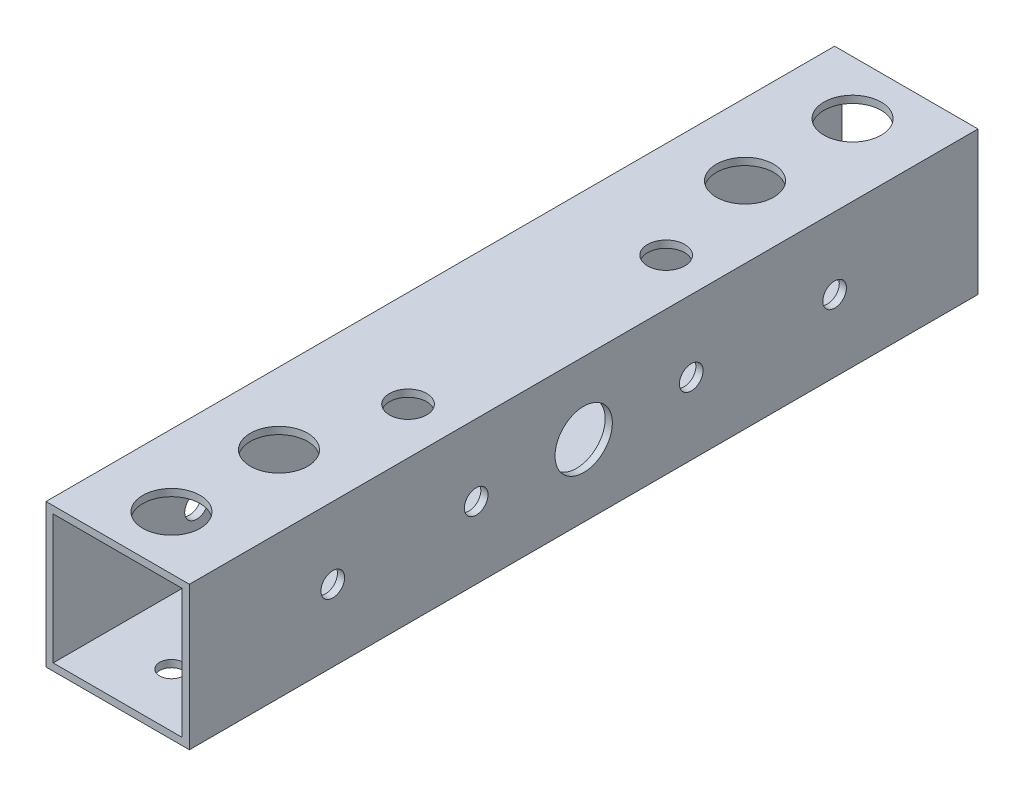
ISO-10303-21;
HEADER;
FILE_DESCRIPTION(('STEP AP214'),'2;1');
FILE_NAME('part.step','',(''),(''),'','','');
FILE_SCHEMA(('AUTOMOTIVE_DESIGN { 1 0 10303 214 1 1 1 1 }'));
ENDSEC;
DATA;
#1=APPLICATION_CONTEXT('core data for automotive mechanical design processes');
#2=APPLICATION_PROTOCOL_DEFINITION('international standard','automotive_design',2000,#1);
#3=PRODUCT_CONTEXT('',#1,'mechanical');
#4=PRODUCT('Part','Part','',(#3));
#5=PRODUCT_RELATED_PRODUCT_CATEGORY('part','',(#4));
#6=PRODUCT_DEFINITION_FORMATION('','',#4);
#7=PRODUCT_DEFINITION_CONTEXT('part definition',#1,'design');
#8=PRODUCT_DEFINITION('design','',#6,#7);
#9=PRODUCT_DEFINITION_SHAPE('','',#8);
#10=(LENGTH_UNIT() NAMED_UNIT(*) SI_UNIT(.MILLI.,.METRE.));
#11=(NAMED_UNIT(*) PLANE_ANGLE_UNIT() SI_UNIT($,.RADIAN.));
#12=(NAMED_UNIT(*) SI_UNIT($,.STERADIAN.) SOLID_ANGLE_UNIT());
#13=UNCERTAINTY_MEASURE_WITH_UNIT(LENGTH_MEASURE(1.E-05),#10,'distance_accuracy_value','');
#14=(GEOMETRIC_REPRESENTATION_CONTEXT(3) GLOBAL_UNCERTAINTY_ASSIGNED_CONTEXT((#13)) GLOBAL_UNIT_ASSIGNED_CONTEXT((#10,
#11,#12)) REPRESENTATION_CONTEXT('',''));
#15=CARTESIAN_POINT('',(0.,0.,0.));
#16=DIRECTION('',(0.,0.,1.));
#17=DIRECTION('',(1.,0.,0.));
#18=AXIS2_PLACEMENT_3D('',#15,#16,#17);
#19=CARTESIAN_POINT('',(-9.,-9.,110.));
#20=DIRECTION('',(0.,1.,0.));
#21=DIRECTION('',(1.,0.,0.));
#22=AXIS2_PLACEMENT_3D('',#19,#20,#21);
#23=PLANE('',#22);
#24=CARTESIAN_POINT('',(1.52655665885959E-13,-9.,7.50000000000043));
#25=DIRECTION('',(0.,1.,0.));
#26=DIRECTION('',(0.,0.,1.));
#27=AXIS2_PLACEMENT_3D('',#24,#25,#26);
#28=CIRCLE('',#27,1.64999999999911);
#29=CARTESIAN_POINT('',(1.52655665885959E-13,-9.,9.14999999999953));
#30=VERTEX_POINT('',#29);
#31=EDGE_CURVE('E269',#30,#30,#28,.T.);
#32=ORIENTED_EDGE('',*,*,#31,.F.);
#33=EDGE_LOOP('',(#32));
#34=FACE_BOUND('',#33,.T.);
#35=CARTESIAN_POINT('',(1.45716771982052E-13,-9.,22.5000000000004));
#36=DIRECTION('',(0.,1.,0.));
#37=DIRECTION('',(0.,0.,1.));
#38=AXIS2_PLACEMENT_3D('',#35,#36,#37);
#39=CIRCLE('',#38,1.64999999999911);
#40=CARTESIAN_POINT('',(1.45716771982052E-13,-9.,24.1499999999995));
#41=VERTEX_POINT('',#40);
#42=EDGE_CURVE('E278',#41,#41,#39,.T.);
#43=ORIENTED_EDGE('',*,*,#42,.F.);
#44=EDGE_LOOP('',(#43));
#45=FACE_BOUND('',#44,.T.);
#46=CARTESIAN_POINT('',(-2.1163626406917E-13,-9.,87.5));
#47=DIRECTION('',(0.,1.,0.));
#48=DIRECTION('',(0.,0.,1.));
#49=AXIS2_PLACEMENT_3D('',#46,#47,#48);
#50=CIRCLE('',#49,1.64999999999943);
#51=CARTESIAN_POINT('',(-2.1163626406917E-13,-9.,89.1499999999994));
#52=VERTEX_POINT('',#51);
#53=EDGE_CURVE('E246',#52,#52,#50,.T.);
#54=ORIENTED_EDGE('',*,*,#53,.F.);
#55=EDGE_LOOP('',(#54));
#56=FACE_BOUND('',#55,.T.);
#57=CARTESIAN_POINT('',(-2.09901540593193E-13,-9.,102.5));
#58=DIRECTION('',(0.,1.,0.));
#59=DIRECTION('',(0.,0.,1.));
#60=AXIS2_PLACEMENT_3D('',#57,#58,#59);
#61=CIRCLE('',#60,1.64999999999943);
#62=CARTESIAN_POINT('',(-2.09901540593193E-13,-9.,104.149999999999));
#63=VERTEX_POINT('',#62);
#64=EDGE_CURVE('E247',#63,#63,#61,.T.);
#65=ORIENTED_EDGE('',*,*,#64,.F.);
#66=EDGE_LOOP('',(#65));
#67=FACE_BOUND('',#66,.T.);
#68=CARTESIAN_POINT('',(3.50000000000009,-9.,37.));
#69=DIRECTION('',(0.,1.,0.));
#70=DIRECTION('',(0.,0.,1.));
#71=AXIS2_PLACEMENT_3D('',#68,#69,#70);
#72=CIRCLE('',#71,4.);
#73=CARTESIAN_POINT('',(3.50000000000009,-9.,41.));
#74=VERTEX_POINT('',#73);
#75=EDGE_CURVE('E201',#74,#74,#72,.T.);
#76=ORIENTED_EDGE('',*,*,#75,.F.);
#77=EDGE_LOOP('',(#76));
#78=FACE_BOUND('',#77,.T.);
#79=CARTESIAN_POINT('',(3.50000000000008,-9.,73.));
#80=DIRECTION('',(0.,1.,0.));
#81=DIRECTION('',(0.,0.,1.));
#82=AXIS2_PLACEMENT_3D('',#79,#80,#81);
#83=CIRCLE('',#82,4.);
#84=CARTESIAN_POINT('',(3.50000000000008,-9.,77.));
#85=VERTEX_POINT('',#84);
#86=EDGE_CURVE('E193',#85,#85,#83,.T.);
#87=ORIENTED_EDGE('',*,*,#86,.F.);
#88=EDGE_LOOP('',(#87));
#89=FACE_BOUND('',#88,.T.);
#90=DIRECTION('',(1.,0.,0.));
#91=VECTOR('',#90,1.);
#92=CARTESIAN_POINT('',(-9.,-9.,0.));
#93=LINE('',#92,#91);
#94=CARTESIAN_POINT('',(-9.,-9.,0.));
#95=VERTEX_POINT('',#94);
#96=CARTESIAN_POINT('',(9.,-9.,0.));
#97=VERTEX_POINT('',#96);
#98=EDGE_CURVE('E236',#95,#97,#93,.T.);
#99=ORIENTED_EDGE('',*,*,#98,.F.);
#100=DIRECTION('',(0.,0.,-1.));
#101=VECTOR('',#100,1.);
#102=CARTESIAN_POINT('',(-9.,-9.,110.));
#103=LINE('',#102,#101);
#104=CARTESIAN_POINT('',(-9.,-9.,110.));
#105=VERTEX_POINT('',#104);
#106=EDGE_CURVE('E11',#105,#95,#103,.T.);
#107=ORIENTED_EDGE('',*,*,#106,.F.);
#108=DIRECTION('',(1.,0.,0.));
#109=VECTOR('',#108,1.);
#110=CARTESIAN_POINT('',(-9.,-9.,110.));
#111=LINE('',#110,#109);
#112=CARTESIAN_POINT('',(9.,-9.,110.));
#113=VERTEX_POINT('',#112);
#114=EDGE_CURVE('E117',#105,#113,#111,.T.);
#115=ORIENTED_EDGE('',*,*,#114,.T.);
#116=DIRECTION('',(0.,0.,-1.));
#117=VECTOR('',#116,1.);
#118=CARTESIAN_POINT('',(9.,-9.,110.));
#119=LINE('',#118,#117);
#120=EDGE_CURVE('E103',#113,#97,#119,.T.);
#121=ORIENTED_EDGE('',*,*,#120,.T.);
#122=EDGE_LOOP('',(#99,#107,#115,#121));
#123=FACE_BOUND('',#122,.T.);
#124=ADVANCED_FACE('F17',(#34,#45,#56,#67,#78,#89,#123),#23,.T.);
#125=CARTESIAN_POINT('',(-9.,-9.,110.));
#126=DIRECTION('',(1.,0.,0.));
#127=DIRECTION('',(0.,1.,0.));
#128=AXIS2_PLACEMENT_3D('',#125,#126,#127);
#129=PLANE('',#128);
#130=CARTESIAN_POINT('',(-9.,0.,55.));
#131=DIRECTION('',(1.,0.,0.));
#132=DIRECTION('',(0.,0.,-1.));
#133=AXIS2_PLACEMENT_3D('',#130,#131,#132);
#134=CIRCLE('',#133,4.);
#135=CARTESIAN_POINT('',(-9.,0.,51.));
#136=VERTEX_POINT('',#135);
#137=EDGE_CURVE('E189',#136,#136,#134,.T.);
#138=ORIENTED_EDGE('',*,*,#137,.F.);
#139=EDGE_LOOP('',(#138));
#140=FACE_BOUND('',#139,.T.);
#141=CARTESIAN_POINT('',(-9.,0.,40.));
#142=DIRECTION('',(1.,0.,0.));
#143=DIRECTION('',(0.,0.,-1.));
#144=AXIS2_PLACEMENT_3D('',#141,#142,#143);
#145=CIRCLE('',#144,1.65);
#146=CARTESIAN_POINT('',(-9.,0.,38.35));
#147=VERTEX_POINT('',#146);
#148=EDGE_CURVE('E181',#147,#147,#145,.T.);
#149=ORIENTED_EDGE('',*,*,#148,.F.);
#150=EDGE_LOOP('',(#149));
#151=FACE_BOUND('',#150,.T.);
#152=CARTESIAN_POINT('',(-9.,0.,20.));
#153=DIRECTION('',(1.,0.,0.));
#154=DIRECTION('',(0.,0.,-1.));
#155=AXIS2_PLACEMENT_3D('',#152,#153,#154);
#156=CIRCLE('',#155,1.65);
#157=CARTESIAN_POINT('',(-9.,0.,18.35));
#158=VERTEX_POINT('',#157);
#159=EDGE_CURVE('E159',#158,#158,#156,.T.);
#160=ORIENTED_EDGE('',*,*,#159,.F.);
#161=EDGE_LOOP('',(#160));
#162=FACE_BOUND('',#161,.T.);
#163=CARTESIAN_POINT('',(-9.,0.,70.));
#164=DIRECTION('',(1.,0.,0.));
#165=DIRECTION('',(0.,0.,-1.));
#166=AXIS2_PLACEMENT_3D('',#163,#164,#165);
#167=CIRCLE('',#166,1.65);
#168=CARTESIAN_POINT('',(-9.,0.,68.35));
#169=VERTEX_POINT('',#168);
#170=EDGE_CURVE('E151',#169,#169,#167,.T.);
#171=ORIENTED_EDGE('',*,*,#170,.F.);
#172=EDGE_LOOP('',(#171));
#173=FACE_BOUND('',#172,.T.);
#174=CARTESIAN_POINT('',(-9.,0.,90.));
#175=DIRECTION('',(1.,0.,0.));
#176=DIRECTION('',(0.,0.,-1.));
#177=AXIS2_PLACEMENT_3D('',#174,#175,#176);
#178=CIRCLE('',#177,1.65);
#179=CARTESIAN_POINT('',(-9.,0.,88.35));
#180=VERTEX_POINT('',#179);
#181=EDGE_CURVE('E142',#180,#180,#178,.T.);
#182=ORIENTED_EDGE('',*,*,#181,.F.);
#183=EDGE_LOOP('',(#182));
#184=FACE_BOUND('',#183,.T.);
#185=DIRECTION('',(0.,-1.,0.));
#186=VECTOR('',#185,1.);
#187=CARTESIAN_POINT('',(-9.,-9.,0.));
#188=LINE('',#187,#186);
#189=CARTESIAN_POINT('',(-9.,9.,0.));
#190=VERTEX_POINT('',#189);
#191=EDGE_CURVE('E300',#190,#95,#188,.T.);
#192=ORIENTED_EDGE('',*,*,#191,.F.);
#193=DIRECTION('',(0.,0.,-1.));
#194=VECTOR('',#193,1.);
#195=CARTESIAN_POINT('',(-9.,9.,110.));
#196=LINE('',#195,#194);
#197=CARTESIAN_POINT('',(-9.,9.,110.));
#198=VERTEX_POINT('',#197);
#199=EDGE_CURVE('E25',#198,#190,#196,.T.);
#200=ORIENTED_EDGE('',*,*,#199,.F.);
#201=DIRECTION('',(0.,-1.,0.));
#202=VECTOR('',#201,1.);
#203=CARTESIAN_POINT('',(-9.,-9.,110.));
#204=LINE('',#203,#202);
#205=EDGE_CURVE('E122',#198,#105,#204,.T.);
#206=ORIENTED_EDGE('',*,*,#205,.T.);
#207=ORIENTED_EDGE('',*,*,#106,.T.);
#208=EDGE_LOOP('',(#192,#200,#206,#207));
#209=FACE_BOUND('',#208,.T.);
#210=ADVANCED_FACE('F1162',(#140,#151,#162,#173,#184,#209),#129,.T.);
#211=CARTESIAN_POINT('',(-9.,9.,110.));
#212=DIRECTION('',(0.,-1.,0.));
#213=DIRECTION('',(0.,0.,-1.));
#214=AXIS2_PLACEMENT_3D('',#211,#212,#213);
#215=PLANE('',#214);
#216=CARTESIAN_POINT('',(-8.77770078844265E-13,9.,87.5));
#217=DIRECTION('',(0.,-1.,0.));
#218=DIRECTION('',(0.,0.,-1.));
#219=AXIS2_PLACEMENT_3D('',#216,#217,#218);
#220=CIRCLE('',#219,4.);
#221=CARTESIAN_POINT('',(-8.77770078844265E-13,9.,83.5));
#222=VERTEX_POINT('',#221);
#223=EDGE_CURVE('E216',#222,#222,#220,.T.);
#224=ORIENTED_EDGE('',*,*,#223,.F.);
#225=EDGE_LOOP('',(#224));
#226=FACE_BOUND('',#225,.T.);
#227=CARTESIAN_POINT('',(-8.76035355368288E-13,9.,102.5));
#228=DIRECTION('',(0.,-1.,0.));
#229=DIRECTION('',(0.,0.,-1.));
#230=AXIS2_PLACEMENT_3D('',#227,#228,#229);
#231=CIRCLE('',#230,4.);
#232=CARTESIAN_POINT('',(-8.76035355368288E-13,9.,98.5));
#233=VERTEX_POINT('',#232);
#234=EDGE_CURVE('E217',#233,#233,#231,.T.);
#235=ORIENTED_EDGE('',*,*,#234,.F.);
#236=EDGE_LOOP('',(#235));
#237=FACE_BOUND('',#236,.T.);
#238=CARTESIAN_POINT('',(-7.28583859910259E-13,9.,22.5000000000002));
#239=DIRECTION('',(0.,-1.,0.));
#240=DIRECTION('',(0.,0.,-1.));
#241=AXIS2_PLACEMENT_3D('',#238,#239,#240);
#242=CIRCLE('',#241,4.);
#243=CARTESIAN_POINT('',(-7.28583859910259E-13,9.,18.5000000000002));
#244=VERTEX_POINT('',#243);
#245=EDGE_CURVE('E248',#244,#244,#242,.T.);
#246=ORIENTED_EDGE('',*,*,#245,.F.);
#247=EDGE_LOOP('',(#246));
#248=FACE_BOUND('',#247,.T.);
#249=CARTESIAN_POINT('',(-7.35522753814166E-13,9.,7.50000000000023));
#250=DIRECTION('',(0.,-1.,0.));
#251=DIRECTION('',(0.,0.,-1.));
#252=AXIS2_PLACEMENT_3D('',#249,#250,#251);
#253=CIRCLE('',#252,4.);
#254=CARTESIAN_POINT('',(-7.35522753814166E-13,9.,3.50000000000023));
#255=VERTEX_POINT('',#254);
#256=EDGE_CURVE('E237',#255,#255,#253,.T.);
#257=ORIENTED_EDGE('',*,*,#256,.F.);
#258=EDGE_LOOP('',(#257));
#259=FACE_BOUND('',#258,.T.);
#260=CARTESIAN_POINT('',(3.50000000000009,9.,37.));
#261=DIRECTION('',(0.,-1.,0.));
#262=DIRECTION('',(0.,0.,-1.));
#263=AXIS2_PLACEMENT_3D('',#260,#261,#262);
#264=CIRCLE('',#263,2.6);
#265=CARTESIAN_POINT('',(3.50000000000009,9.,34.4));
#266=VERTEX_POINT('',#265);
#267=EDGE_CURVE('E221',#266,#266,#264,.T.);
#268=ORIENTED_EDGE('',*,*,#267,.F.);
#269=EDGE_LOOP('',(#268));
#270=FACE_BOUND('',#269,.T.);
#271=CARTESIAN_POINT('',(3.50000000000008,9.,73.));
#272=DIRECTION('',(0.,-1.,0.));
#273=DIRECTION('',(0.,0.,-1.));
#274=AXIS2_PLACEMENT_3D('',#271,#272,#273);
#275=CIRCLE('',#274,2.6);
#276=CARTESIAN_POINT('',(3.50000000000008,9.,70.4));
#277=VERTEX_POINT('',#276);
#278=EDGE_CURVE('E206',#277,#277,#275,.T.);
#279=ORIENTED_EDGE('',*,*,#278,.F.);
#280=EDGE_LOOP('',(#279));
#281=FACE_BOUND('',#280,.T.);
#282=DIRECTION('',(-1.,0.,0.));
#283=VECTOR('',#282,1.);
#284=CARTESIAN_POINT('',(-9.,9.,0.));
#285=LINE('',#284,#283);
#286=CARTESIAN_POINT('',(9.,9.,0.));
#287=VERTEX_POINT('',#286);
#288=EDGE_CURVE('E258',#287,#190,#285,.T.);
#289=ORIENTED_EDGE('',*,*,#288,.F.);
#290=DIRECTION('',(0.,0.,-1.));
#291=VECTOR('',#290,1.);
#292=CARTESIAN_POINT('',(9.,9.,110.));
#293=LINE('',#292,#291);
#294=CARTESIAN_POINT('',(9.,9.,110.));
#295=VERTEX_POINT('',#294);
#296=EDGE_CURVE('E48',#295,#287,#293,.T.);
#297=ORIENTED_EDGE('',*,*,#296,.F.);
#298=DIRECTION('',(-1.,0.,0.));
#299=VECTOR('',#298,1.);
#300=CARTESIAN_POINT('',(-9.,9.,110.));
#301=LINE('',#300,#299);
#302=EDGE_CURVE('E127',#295,#198,#301,.T.);
#303=ORIENTED_EDGE('',*,*,#302,.T.);
#304=ORIENTED_EDGE('',*,*,#199,.T.);
#305=EDGE_LOOP('',(#289,#297,#303,#304));
#306=FACE_BOUND('',#305,.T.);
#307=ADVANCED_FACE('F1170',(#226,#237,#248,#259,#270,#281,#306),#215,.T.);
#308=CARTESIAN_POINT('',(9.,-9.,110.));
#309=DIRECTION('',(-1.,0.,0.));
#310=DIRECTION('',(0.,0.,1.));
#311=AXIS2_PLACEMENT_3D('',#308,#309,#310);
#312=PLANE('',#311);
#313=CARTESIAN_POINT('',(9.,0.,55.));
#314=DIRECTION('',(-1.,0.,0.));
#315=DIRECTION('',(0.,0.,1.));
#316=AXIS2_PLACEMENT_3D('',#313,#314,#315);
#317=CIRCLE('',#316,4.);
#318=CARTESIAN_POINT('',(9.,0.,59.));
#319=VERTEX_POINT('',#318);
#320=EDGE_CURVE('E627',#319,#319,#317,.T.);
#321=ORIENTED_EDGE('',*,*,#320,.F.);
#322=EDGE_LOOP('',(#321));
#323=FACE_BOUND('',#322,.T.);
#324=CARTESIAN_POINT('',(9.,0.,40.));
#325=DIRECTION('',(-1.,0.,0.));
#326=DIRECTION('',(0.,0.,1.));
#327=AXIS2_PLACEMENT_3D('',#324,#325,#326);
#328=CIRCLE('',#327,1.65);
#329=CARTESIAN_POINT('',(9.,0.,41.65));
#330=VERTEX_POINT('',#329);
#331=EDGE_CURVE('E643',#330,#330,#328,.T.);
#332=ORIENTED_EDGE('',*,*,#331,.F.);
#333=EDGE_LOOP('',(#332));
#334=FACE_BOUND('',#333,.T.);
#335=CARTESIAN_POINT('',(9.,0.,20.));
#336=DIRECTION('',(-1.,0.,0.));
#337=DIRECTION('',(0.,0.,1.));
#338=AXIS2_PLACEMENT_3D('',#335,#336,#337);
#339=CIRCLE('',#338,1.65);
#340=CARTESIAN_POINT('',(9.,0.,21.65));
#341=VERTEX_POINT('',#340);
#342=EDGE_CURVE('E664',#341,#341,#339,.T.);
#343=ORIENTED_EDGE('',*,*,#342,.F.);
#344=EDGE_LOOP('',(#343));
#345=FACE_BOUND('',#344,.T.);
#346=CARTESIAN_POINT('',(9.,0.,70.));
#347=DIRECTION('',(-1.,0.,0.));
#348=DIRECTION('',(0.,0.,1.));
#349=AXIS2_PLACEMENT_3D('',#346,#347,#348);
#350=CIRCLE('',#349,1.65);
#351=CARTESIAN_POINT('',(9.,0.,71.65));
#352=VERTEX_POINT('',#351);
#353=EDGE_CURVE('E683',#352,#352,#350,.T.);
#354=ORIENTED_EDGE('',*,*,#353,.F.);
#355=EDGE_LOOP('',(#354));
#356=FACE_BOUND('',#355,.T.);
#357=CARTESIAN_POINT('',(9.,0.,90.));
#358=DIRECTION('',(-1.,0.,0.));
#359=DIRECTION('',(0.,0.,1.));
#360=AXIS2_PLACEMENT_3D('',#357,#358,#359);
#361=CIRCLE('',#360,1.65);
#362=CARTESIAN_POINT('',(9.,0.,91.65));
#363=VERTEX_POINT('',#362);
#364=EDGE_CURVE('E701',#363,#363,#361,.T.);
#365=ORIENTED_EDGE('',*,*,#364,.F.);
#366=EDGE_LOOP('',(#365));
#367=FACE_BOUND('',#366,.T.);
#368=DIRECTION('',(0.,1.,0.));
#369=VECTOR('',#368,1.);
#370=CARTESIAN_POINT('',(9.,-9.,0.));
#371=LINE('',#370,#369);
#372=EDGE_CURVE('E109',#97,#287,#371,.T.);
#373=ORIENTED_EDGE('',*,*,#372,.F.);
#374=ORIENTED_EDGE('',*,*,#120,.F.);
#375=DIRECTION('',(0.,1.,0.));
#376=VECTOR('',#375,1.);
#377=CARTESIAN_POINT('',(9.,-9.,110.));
#378=LINE('',#377,#376);
#379=EDGE_CURVE('E107',#113,#295,#378,.T.);
#380=ORIENTED_EDGE('',*,*,#379,.T.);
#381=ORIENTED_EDGE('',*,*,#296,.T.);
#382=EDGE_LOOP('',(#373,#374,#380,#381));
#383=FACE_BOUND('',#382,.T.);
#384=ADVANCED_FACE('F105',(#323,#334,#345,#356,#367,#383),#312,.T.);
#385=CARTESIAN_POINT('',(-10.,-10.,110.));
#386=DIRECTION('',(0.,1.,0.));
#387=DIRECTION('',(1.,0.,0.));
#388=AXIS2_PLACEMENT_3D('',#385,#386,#387);
#389=PLANE('',#388);
#390=CARTESIAN_POINT('',(1.52655665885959E-13,-10.,7.50000000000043));
#391=DIRECTION('',(0.,-1.,0.));
#392=DIRECTION('',(0.,0.,-1.));
#393=AXIS2_PLACEMENT_3D('',#390,#391,#392);
#394=CIRCLE('',#393,1.64999999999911);
#395=CARTESIAN_POINT('',(1.52655665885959E-13,-10.,5.85000000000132));
#396=VERTEX_POINT('',#395);
#397=EDGE_CURVE('E273',#396,#396,#394,.T.);
#398=ORIENTED_EDGE('',*,*,#397,.F.);
#399=EDGE_LOOP('',(#398));
#400=FACE_BOUND('',#399,.T.);
#401=CARTESIAN_POINT('',(1.45716771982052E-13,-10.,22.5000000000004));
#402=DIRECTION('',(0.,-1.,0.));
#403=DIRECTION('',(0.,0.,-1.));
#404=AXIS2_PLACEMENT_3D('',#401,#402,#403);
#405=CIRCLE('',#404,1.64999999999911);
#406=CARTESIAN_POINT('',(1.45716771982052E-13,-10.,20.8500000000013));
#407=VERTEX_POINT('',#406);
#408=EDGE_CURVE('E274',#407,#407,#405,.T.);
#409=ORIENTED_EDGE('',*,*,#408,.F.);
#410=EDGE_LOOP('',(#409));
#411=FACE_BOUND('',#410,.T.);
#412=CARTESIAN_POINT('',(-2.1163626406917E-13,-10.,87.5));
#413=DIRECTION('',(0.,-1.,0.));
#414=DIRECTION('',(0.,0.,-1.));
#415=AXIS2_PLACEMENT_3D('',#412,#413,#414);
#416=CIRCLE('',#415,1.64999999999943);
#417=CARTESIAN_POINT('',(-2.1163626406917E-13,-10.,85.8500000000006));
#418=VERTEX_POINT('',#417);
#419=EDGE_CURVE('E268',#418,#418,#416,.T.);
#420=ORIENTED_EDGE('',*,*,#419,.F.);
#421=EDGE_LOOP('',(#420));
#422=FACE_BOUND('',#421,.T.);
#423=CARTESIAN_POINT('',(-2.09901540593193E-13,-10.,102.5));
#424=DIRECTION('',(0.,-1.,0.));
#425=DIRECTION('',(0.,0.,-1.));
#426=AXIS2_PLACEMENT_3D('',#423,#424,#425);
#427=CIRCLE('',#426,1.64999999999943);
#428=CARTESIAN_POINT('',(-2.09901540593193E-13,-10.,100.850000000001));
#429=VERTEX_POINT('',#428);
#430=EDGE_CURVE('E242',#429,#429,#427,.T.);
#431=ORIENTED_EDGE('',*,*,#430,.F.);
#432=EDGE_LOOP('',(#431));
#433=FACE_BOUND('',#432,.T.);
#434=CARTESIAN_POINT('',(3.50000000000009,-10.,37.));
#435=DIRECTION('',(0.,-1.,0.));
#436=DIRECTION('',(0.,0.,-1.));
#437=AXIS2_PLACEMENT_3D('',#434,#435,#436);
#438=CIRCLE('',#437,4.);
#439=CARTESIAN_POINT('',(3.50000000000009,-10.,33.));
#440=VERTEX_POINT('',#439);
#441=EDGE_CURVE('E211',#440,#440,#438,.T.);
#442=ORIENTED_EDGE('',*,*,#441,.F.);
#443=EDGE_LOOP('',(#442));
#444=FACE_BOUND('',#443,.T.);
#445=CARTESIAN_POINT('',(3.50000000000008,-10.,73.));
#446=DIRECTION('',(0.,-1.,0.));
#447=DIRECTION('',(0.,0.,-1.));
#448=AXIS2_PLACEMENT_3D('',#445,#446,#447);
#449=CIRCLE('',#448,4.);
#450=CARTESIAN_POINT('',(3.50000000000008,-10.,69.));
#451=VERTEX_POINT('',#450);
#452=EDGE_CURVE('E197',#451,#451,#449,.T.);
#453=ORIENTED_EDGE('',*,*,#452,.F.);
#454=EDGE_LOOP('',(#453));
#455=FACE_BOUND('',#454,.T.);
#456=DIRECTION('',(1.,0.,0.));
#457=VECTOR('',#456,1.);
#458=CARTESIAN_POINT('',(-10.,-10.,0.));
#459=LINE('',#458,#457);
#460=CARTESIAN_POINT('',(-10.,-10.,0.));
#461=VERTEX_POINT('',#460);
#462=CARTESIAN_POINT('',(10.,-10.,0.));
#463=VERTEX_POINT('',#462);
#464=EDGE_CURVE('E173',#461,#463,#459,.T.);
#465=ORIENTED_EDGE('',*,*,#464,.T.);
#466=DIRECTION('',(0.,0.,-1.));
#467=VECTOR('',#466,1.);
#468=CARTESIAN_POINT('',(10.,-10.,110.));
#469=LINE('',#468,#467);
#470=CARTESIAN_POINT('',(10.,-10.,110.));
#471=VERTEX_POINT('',#470);
#472=EDGE_CURVE('E160',#471,#463,#469,.T.);
#473=ORIENTED_EDGE('',*,*,#472,.F.);
#474=DIRECTION('',(1.,0.,0.));
#475=VECTOR('',#474,1.);
#476=CARTESIAN_POINT('',(-10.,-10.,110.));
#477=LINE('',#476,#475);
#478=CARTESIAN_POINT('',(-10.,-10.,110.));
#479=VERTEX_POINT('',#478);
#480=EDGE_CURVE('E129',#479,#471,#477,.T.);
#481=ORIENTED_EDGE('',*,*,#480,.F.);
#482=DIRECTION('',(0.,0.,-1.));
#483=VECTOR('',#482,1.);
#484=CARTESIAN_POINT('',(-10.,-10.,110.));
#485=LINE('',#484,#483);
#486=EDGE_CURVE('E114',#479,#461,#485,.T.);
#487=ORIENTED_EDGE('',*,*,#486,.T.);
#488=EDGE_LOOP('',(#465,#473,#481,#487));
#489=FACE_BOUND('',#488,.T.);
#490=ADVANCED_FACE('F1186',(#400,#411,#422,#433,#444,#455,#489),#389,.F.);
#491=CARTESIAN_POINT('',(-10.,-10.,110.));
#492=DIRECTION('',(1.,0.,0.));
#493=DIRECTION('',(0.,1.,0.));
#494=AXIS2_PLACEMENT_3D('',#491,#492,#493);
#495=PLANE('',#494);
#496=CARTESIAN_POINT('',(-10.,0.,55.));
#497=DIRECTION('',(1.,0.,0.));
#498=DIRECTION('',(0.,0.,-1.));
#499=AXIS2_PLACEMENT_3D('',#496,#497,#498);
#500=CIRCLE('',#499,4.);
#501=CARTESIAN_POINT('',(-10.,0.,51.));
#502=VERTEX_POINT('',#501);
#503=EDGE_CURVE('E185',#502,#502,#500,.T.);
#504=ORIENTED_EDGE('',*,*,#503,.T.);
#505=EDGE_LOOP('',(#504));
#506=FACE_BOUND('',#505,.T.);
#507=CARTESIAN_POINT('',(-10.,0.,40.));
#508=DIRECTION('',(1.,0.,0.));
#509=DIRECTION('',(0.,0.,-1.));
#510=AXIS2_PLACEMENT_3D('',#507,#508,#509);
#511=CIRCLE('',#510,1.65);
#512=CARTESIAN_POINT('',(-10.,0.,38.35));
#513=VERTEX_POINT('',#512);
#514=EDGE_CURVE('E177',#513,#513,#511,.T.);
#515=ORIENTED_EDGE('',*,*,#514,.T.);
#516=EDGE_LOOP('',(#515));
#517=FACE_BOUND('',#516,.T.);
#518=CARTESIAN_POINT('',(-10.,0.,20.));
#519=DIRECTION('',(1.,0.,0.));
#520=DIRECTION('',(0.,0.,-1.));
#521=AXIS2_PLACEMENT_3D('',#518,#519,#520);
#522=CIRCLE('',#521,1.65);
#523=CARTESIAN_POINT('',(-10.,0.,18.35));
#524=VERTEX_POINT('',#523);
#525=EDGE_CURVE('E155',#524,#524,#522,.T.);
#526=ORIENTED_EDGE('',*,*,#525,.T.);
#527=EDGE_LOOP('',(#526));
#528=FACE_BOUND('',#527,.T.);
#529=CARTESIAN_POINT('',(-10.,0.,70.));
#530=DIRECTION('',(1.,0.,0.));
#531=DIRECTION('',(0.,0.,-1.));
#532=AXIS2_PLACEMENT_3D('',#529,#530,#531);
#533=CIRCLE('',#532,1.65);
#534=CARTESIAN_POINT('',(-10.,0.,68.35));
#535=VERTEX_POINT('',#534);
#536=EDGE_CURVE('E146',#535,#535,#533,.T.);
#537=ORIENTED_EDGE('',*,*,#536,.T.);
#538=EDGE_LOOP('',(#537));
#539=FACE_BOUND('',#538,.T.);
#540=CARTESIAN_POINT('',(-10.,0.,90.));
#541=DIRECTION('',(1.,0.,0.));
#542=DIRECTION('',(0.,0.,-1.));
#543=AXIS2_PLACEMENT_3D('',#540,#541,#542);
#544=CIRCLE('',#543,1.65);
#545=CARTESIAN_POINT('',(-10.,0.,88.35));
#546=VERTEX_POINT('',#545);
#547=EDGE_CURVE('E147',#546,#546,#544,.T.);
#548=ORIENTED_EDGE('',*,*,#547,.T.);
#549=EDGE_LOOP('',(#548));
#550=FACE_BOUND('',#549,.T.);
#551=DIRECTION('',(0.,-1.,0.));
#552=VECTOR('',#551,1.);
#553=CARTESIAN_POINT('',(-10.,-10.,0.));
#554=LINE('',#553,#552);
#555=CARTESIAN_POINT('',(-10.,10.,0.));
#556=VERTEX_POINT('',#555);
#557=EDGE_CURVE('E168',#556,#461,#554,.T.);
#558=ORIENTED_EDGE('',*,*,#557,.T.);
#559=ORIENTED_EDGE('',*,*,#486,.F.);
#560=DIRECTION('',(0.,-1.,0.));
#561=VECTOR('',#560,1.);
#562=CARTESIAN_POINT('',(-10.,-10.,110.));
#563=LINE('',#562,#561);
#564=CARTESIAN_POINT('',(-10.,10.,110.));
#565=VERTEX_POINT('',#564);
#566=EDGE_CURVE('E136',#565,#479,#563,.T.);
#567=ORIENTED_EDGE('',*,*,#566,.F.);
#568=DIRECTION('',(0.,0.,-1.));
#569=VECTOR('',#568,1.);
#570=CARTESIAN_POINT('',(-10.,10.,110.));
#571=LINE('',#570,#569);
#572=EDGE_CURVE('E163',#565,#556,#571,.T.);
#573=ORIENTED_EDGE('',*,*,#572,.T.);
#574=EDGE_LOOP('',(#558,#559,#567,#573));
#575=FACE_BOUND('',#574,.T.);
#576=ADVANCED_FACE('F1195',(#506,#517,#528,#539,#550,#575),#495,.F.);
#577=CARTESIAN_POINT('',(-10.,10.,110.));
#578=DIRECTION('',(0.,-1.,0.));
#579=DIRECTION('',(0.,0.,-1.));
#580=AXIS2_PLACEMENT_3D('',#577,#578,#579);
#581=PLANE('',#580);
#582=CARTESIAN_POINT('',(-8.77770078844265E-13,10.,87.5));
#583=DIRECTION('',(0.,-1.,0.));
#584=DIRECTION('',(0.,0.,-1.));
#585=AXIS2_PLACEMENT_3D('',#582,#583,#584);
#586=CIRCLE('',#585,4.);
#587=CARTESIAN_POINT('',(-8.77770078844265E-13,10.,83.5));
#588=VERTEX_POINT('',#587);
#589=EDGE_CURVE('E212',#588,#588,#586,.T.);
#590=ORIENTED_EDGE('',*,*,#589,.T.);
#591=EDGE_LOOP('',(#590));
#592=FACE_BOUND('',#591,.T.);
#593=CARTESIAN_POINT('',(-8.76035355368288E-13,10.,102.5));
#594=DIRECTION('',(0.,-1.,0.));
#595=DIRECTION('',(0.,0.,-1.));
#596=AXIS2_PLACEMENT_3D('',#593,#594,#595);
#597=CIRCLE('',#596,4.);
#598=CARTESIAN_POINT('',(-8.76035355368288E-13,10.,98.5));
#599=VERTEX_POINT('',#598);
#600=EDGE_CURVE('E252',#599,#599,#597,.T.);
#601=ORIENTED_EDGE('',*,*,#600,.T.);
#602=EDGE_LOOP('',(#601));
#603=FACE_BOUND('',#602,.T.);
#604=CARTESIAN_POINT('',(-7.28583859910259E-13,10.,22.5000000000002));
#605=DIRECTION('',(0.,-1.,0.));
#606=DIRECTION('',(0.,0.,-1.));
#607=AXIS2_PLACEMENT_3D('',#604,#605,#606);
#608=CIRCLE('',#607,4.);
#609=CARTESIAN_POINT('',(-7.28583859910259E-13,10.,18.5000000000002));
#610=VERTEX_POINT('',#609);
#611=EDGE_CURVE('E241',#610,#610,#608,.T.);
#612=ORIENTED_EDGE('',*,*,#611,.T.);
#613=EDGE_LOOP('',(#612));
#614=FACE_BOUND('',#613,.T.);
#615=CARTESIAN_POINT('',(-7.35522753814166E-13,10.,7.50000000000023));
#616=DIRECTION('',(0.,-1.,0.));
#617=DIRECTION('',(0.,0.,-1.));
#618=AXIS2_PLACEMENT_3D('',#615,#616,#617);
#619=CIRCLE('',#618,4.);
#620=CARTESIAN_POINT('',(-7.35522753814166E-13,10.,3.50000000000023));
#621=VERTEX_POINT('',#620);
#622=EDGE_CURVE('E232',#621,#621,#619,.T.);
#623=ORIENTED_EDGE('',*,*,#622,.T.);
#624=EDGE_LOOP('',(#623));
#625=FACE_BOUND('',#624,.T.);
#626=CARTESIAN_POINT('',(3.50000000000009,10.,37.));
#627=DIRECTION('',(0.,1.,0.));
#628=DIRECTION('',(0.,0.,1.));
#629=AXIS2_PLACEMENT_3D('',#626,#627,#628);
#630=CIRCLE('',#629,2.6);
#631=CARTESIAN_POINT('',(3.50000000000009,10.,39.6));
#632=VERTEX_POINT('',#631);
#633=EDGE_CURVE('E225',#632,#632,#630,.T.);
#634=ORIENTED_EDGE('',*,*,#633,.F.);
#635=EDGE_LOOP('',(#634));
#636=FACE_BOUND('',#635,.T.);
#637=CARTESIAN_POINT('',(3.50000000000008,10.,73.));
#638=DIRECTION('',(0.,1.,0.));
#639=DIRECTION('',(0.,0.,1.));
#640=AXIS2_PLACEMENT_3D('',#637,#638,#639);
#641=CIRCLE('',#640,2.6);
#642=CARTESIAN_POINT('',(3.50000000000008,10.,75.6));
#643=VERTEX_POINT('',#642);
#644=EDGE_CURVE('E210',#643,#643,#641,.T.);
#645=ORIENTED_EDGE('',*,*,#644,.F.);
#646=EDGE_LOOP('',(#645));
#647=FACE_BOUND('',#646,.T.);
#648=DIRECTION('',(-1.,0.,0.));
#649=VECTOR('',#648,1.);
#650=CARTESIAN_POINT('',(-10.,10.,0.));
#651=LINE('',#650,#649);
#652=CARTESIAN_POINT('',(10.,10.,0.));
#653=VERTEX_POINT('',#652);
#654=EDGE_CURVE('E172',#653,#556,#651,.T.);
#655=ORIENTED_EDGE('',*,*,#654,.T.);
#656=ORIENTED_EDGE('',*,*,#572,.F.);
#657=DIRECTION('',(-1.,0.,0.));
#658=VECTOR('',#657,1.);
#659=CARTESIAN_POINT('',(-10.,10.,110.));
#660=LINE('',#659,#658);
#661=CARTESIAN_POINT('',(10.,10.,110.));
#662=VERTEX_POINT('',#661);
#663=EDGE_CURVE('E205',#662,#565,#660,.T.);
#664=ORIENTED_EDGE('',*,*,#663,.F.);
#665=DIRECTION('',(0.,0.,-1.));
#666=VECTOR('',#665,1.);
#667=CARTESIAN_POINT('',(10.,10.,110.));
#668=LINE('',#667,#666);
#669=EDGE_CURVE('E164',#662,#653,#668,.T.);
#670=ORIENTED_EDGE('',*,*,#669,.T.);
#671=EDGE_LOOP('',(#655,#656,#664,#670));
#672=FACE_BOUND('',#671,.T.);
#673=ADVANCED_FACE('F1204',(#592,#603,#614,#625,#636,#647,#672),#581,.F.);
#674=CARTESIAN_POINT('',(10.,-10.,110.));
#675=DIRECTION('',(-1.,0.,0.));
#676=DIRECTION('',(0.,0.,1.));
#677=AXIS2_PLACEMENT_3D('',#674,#675,#676);
#678=PLANE('',#677);
#679=CARTESIAN_POINT('',(10.,0.,55.));
#680=DIRECTION('',(1.,0.,0.));
#681=DIRECTION('',(0.,0.,-1.));
#682=AXIS2_PLACEMENT_3D('',#679,#680,#681);
#683=CIRCLE('',#682,4.);
#684=CARTESIAN_POINT('',(10.,0.,51.));
#685=VERTEX_POINT('',#684);
#686=EDGE_CURVE('E140',#685,#685,#683,.T.);
#687=ORIENTED_EDGE('',*,*,#686,.F.);
#688=EDGE_LOOP('',(#687));
#689=FACE_BOUND('',#688,.T.);
#690=CARTESIAN_POINT('',(10.,0.,40.));
#691=DIRECTION('',(1.,0.,0.));
#692=DIRECTION('',(0.,0.,-1.));
#693=AXIS2_PLACEMENT_3D('',#690,#691,#692);
#694=CIRCLE('',#693,1.65);
#695=CARTESIAN_POINT('',(10.,0.,38.35));
#696=VERTEX_POINT('',#695);
#697=EDGE_CURVE('E635',#696,#696,#694,.T.);
#698=ORIENTED_EDGE('',*,*,#697,.F.);
#699=EDGE_LOOP('',(#698));
#700=FACE_BOUND('',#699,.T.);
#701=CARTESIAN_POINT('',(10.,0.,20.));
#702=DIRECTION('',(1.,0.,0.));
#703=DIRECTION('',(0.,0.,-1.));
#704=AXIS2_PLACEMENT_3D('',#701,#702,#703);
#705=CIRCLE('',#704,1.65);
#706=CARTESIAN_POINT('',(10.,0.,18.35));
#707=VERTEX_POINT('',#706);
#708=EDGE_CURVE('E653',#707,#707,#705,.T.);
#709=ORIENTED_EDGE('',*,*,#708,.F.);
#710=EDGE_LOOP('',(#709));
#711=FACE_BOUND('',#710,.T.);
#712=CARTESIAN_POINT('',(10.,0.,70.));
#713=DIRECTION('',(1.,0.,0.));
#714=DIRECTION('',(0.,0.,-1.));
#715=AXIS2_PLACEMENT_3D('',#712,#713,#714);
#716=CIRCLE('',#715,1.65);
#717=CARTESIAN_POINT('',(10.,0.,68.35));
#718=VERTEX_POINT('',#717);
#719=EDGE_CURVE('E674',#718,#718,#716,.T.);
#720=ORIENTED_EDGE('',*,*,#719,.F.);
#721=EDGE_LOOP('',(#720));
#722=FACE_BOUND('',#721,.T.);
#723=CARTESIAN_POINT('',(10.,0.,90.));
#724=DIRECTION('',(1.,0.,0.));
#725=DIRECTION('',(0.,0.,-1.));
#726=AXIS2_PLACEMENT_3D('',#723,#724,#725);
#727=CIRCLE('',#726,1.65);
#728=CARTESIAN_POINT('',(10.,0.,88.35));
#729=VERTEX_POINT('',#728);
#730=EDGE_CURVE('E692',#729,#729,#727,.T.);
#731=ORIENTED_EDGE('',*,*,#730,.F.);
#732=EDGE_LOOP('',(#731));
#733=FACE_BOUND('',#732,.T.);
#734=DIRECTION('',(0.,1.,0.));
#735=VECTOR('',#734,1.);
#736=CARTESIAN_POINT('',(10.,-10.,0.));
#737=LINE('',#736,#735);
#738=EDGE_CURVE('E167',#463,#653,#737,.T.);
#739=ORIENTED_EDGE('',*,*,#738,.T.);
#740=ORIENTED_EDGE('',*,*,#669,.F.);
#741=DIRECTION('',(0.,1.,0.));
#742=VECTOR('',#741,1.);
#743=CARTESIAN_POINT('',(10.,-10.,110.));
#744=LINE('',#743,#742);
#745=EDGE_CURVE('E288',#471,#662,#744,.T.);
#746=ORIENTED_EDGE('',*,*,#745,.F.);
#747=ORIENTED_EDGE('',*,*,#472,.T.);
#748=EDGE_LOOP('',(#739,#740,#746,#747));
#749=FACE_BOUND('',#748,.T.);
#750=ADVANCED_FACE('F1213',(#689,#700,#711,#722,#733,#749),#678,.F.);
#751=CARTESIAN_POINT('',(0.,0.,0.));
#752=DIRECTION('',(0.,0.,-1.));
#753=DIRECTION('',(0.,-1.,0.));
#754=AXIS2_PLACEMENT_3D('',#751,#752,#753);
#755=PLANE('',#754);
#756=ORIENTED_EDGE('',*,*,#98,.T.);
#757=ORIENTED_EDGE('',*,*,#372,.T.);
#758=ORIENTED_EDGE('',*,*,#288,.T.);
#759=ORIENTED_EDGE('',*,*,#191,.T.);
#760=EDGE_LOOP('',(#756,#757,#758,#759));
#761=FACE_BOUND('',#760,.T.);
#762=ORIENTED_EDGE('',*,*,#738,.F.);
#763=ORIENTED_EDGE('',*,*,#464,.F.);
#764=ORIENTED_EDGE('',*,*,#557,.F.);
#765=ORIENTED_EDGE('',*,*,#654,.F.);
#766=EDGE_LOOP('',(#762,#763,#764,#765));
#767=FACE_BOUND('',#766,.T.);
#768=ADVANCED_FACE('F1219',(#761,#767),#755,.T.);
#769=CARTESIAN_POINT('',(0.,0.,110.));
#770=DIRECTION('',(0.,0.,-1.));
#771=DIRECTION('',(0.,-1.,0.));
#772=AXIS2_PLACEMENT_3D('',#769,#770,#771);
#773=PLANE('',#772);
#774=ORIENTED_EDGE('',*,*,#379,.F.);
#775=ORIENTED_EDGE('',*,*,#114,.F.);
#776=ORIENTED_EDGE('',*,*,#205,.F.);
#777=ORIENTED_EDGE('',*,*,#302,.F.);
#778=EDGE_LOOP('',(#774,#775,#776,#777));
#779=FACE_BOUND('',#778,.T.);
#780=ORIENTED_EDGE('',*,*,#745,.T.);
#781=ORIENTED_EDGE('',*,*,#663,.T.);
#782=ORIENTED_EDGE('',*,*,#566,.T.);
#783=ORIENTED_EDGE('',*,*,#480,.T.);
#784=EDGE_LOOP('',(#780,#781,#782,#783));
#785=FACE_BOUND('',#784,.T.);
#786=ADVANCED_FACE('F125',(#779,#785),#773,.F.);
#787=CARTESIAN_POINT('',(1.52655665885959E-13,0.,7.50000000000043));
#788=DIRECTION('',(0.,-1.,0.));
#789=DIRECTION('',(0.,0.,-1.));
#790=AXIS2_PLACEMENT_3D('',#787,#788,#789);
#791=CYLINDRICAL_SURFACE('',#790,1.64999999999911);
#792=ORIENTED_EDGE('',*,*,#397,.T.);
#793=EDGE_LOOP('',(#792));
#794=FACE_BOUND('',#793,.T.);
#795=ORIENTED_EDGE('',*,*,#31,.T.);
#796=EDGE_LOOP('',(#795));
#797=FACE_BOUND('',#796,.T.);
#798=ADVANCED_FACE('F1039',(#794,#797),#791,.F.);
#799=CARTESIAN_POINT('',(1.45716771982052E-13,0.,22.5000000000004));
#800=DIRECTION('',(0.,-1.,0.));
#801=DIRECTION('',(0.,0.,-1.));
#802=AXIS2_PLACEMENT_3D('',#799,#800,#801);
#803=CYLINDRICAL_SURFACE('',#802,1.64999999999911);
#804=ORIENTED_EDGE('',*,*,#408,.T.);
#805=EDGE_LOOP('',(#804));
#806=FACE_BOUND('',#805,.T.);
#807=ORIENTED_EDGE('',*,*,#42,.T.);
#808=EDGE_LOOP('',(#807));
#809=FACE_BOUND('',#808,.T.);
#810=ADVANCED_FACE('F1027',(#806,#809),#803,.F.);
#811=CARTESIAN_POINT('',(-2.1163626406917E-13,0.,87.5));
#812=DIRECTION('',(0.,-1.,0.));
#813=DIRECTION('',(0.,0.,-1.));
#814=AXIS2_PLACEMENT_3D('',#811,#812,#813);
#815=CYLINDRICAL_SURFACE('',#814,1.64999999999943);
#816=ORIENTED_EDGE('',*,*,#419,.T.);
#817=EDGE_LOOP('',(#816));
#818=FACE_BOUND('',#817,.T.);
#819=ORIENTED_EDGE('',*,*,#53,.T.);
#820=EDGE_LOOP('',(#819));
#821=FACE_BOUND('',#820,.T.);
#822=ADVANCED_FACE('F1015',(#818,#821),#815,.F.);
#823=CARTESIAN_POINT('',(-2.09901540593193E-13,0.,102.5));
#824=DIRECTION('',(0.,-1.,0.));
#825=DIRECTION('',(0.,0.,-1.));
#826=AXIS2_PLACEMENT_3D('',#823,#824,#825);
#827=CYLINDRICAL_SURFACE('',#826,1.64999999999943);
#828=ORIENTED_EDGE('',*,*,#430,.T.);
#829=EDGE_LOOP('',(#828));
#830=FACE_BOUND('',#829,.T.);
#831=ORIENTED_EDGE('',*,*,#64,.T.);
#832=EDGE_LOOP('',(#831));
#833=FACE_BOUND('',#832,.T.);
#834=ADVANCED_FACE('F1003',(#830,#833),#827,.F.);
#835=CARTESIAN_POINT('',(-8.77770078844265E-13,19.,87.5));
#836=DIRECTION('',(0.,-1.,0.));
#837=DIRECTION('',(0.,0.,-1.));
#838=AXIS2_PLACEMENT_3D('',#835,#836,#837);
#839=CYLINDRICAL_SURFACE('',#838,4.);
#840=ORIENTED_EDGE('',*,*,#223,.T.);
#841=EDGE_LOOP('',(#840));
#842=FACE_BOUND('',#841,.T.);
#843=ORIENTED_EDGE('',*,*,#589,.F.);
#844=EDGE_LOOP('',(#843));
#845=FACE_BOUND('',#844,.T.);
#846=ADVANCED_FACE('F991',(#842,#845),#839,.F.);
#847=CARTESIAN_POINT('',(-8.76035355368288E-13,19.,102.5));
#848=DIRECTION('',(0.,-1.,0.));
#849=DIRECTION('',(0.,0.,-1.));
#850=AXIS2_PLACEMENT_3D('',#847,#848,#849);
#851=CYLINDRICAL_SURFACE('',#850,4.);
#852=ORIENTED_EDGE('',*,*,#234,.T.);
#853=EDGE_LOOP('',(#852));
#854=FACE_BOUND('',#853,.T.);
#855=ORIENTED_EDGE('',*,*,#600,.F.);
#856=EDGE_LOOP('',(#855));
#857=FACE_BOUND('',#856,.T.);
#858=ADVANCED_FACE('F979',(#854,#857),#851,.F.);
#859=CARTESIAN_POINT('',(-7.28583859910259E-13,19.,22.5000000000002));
#860=DIRECTION('',(0.,-1.,0.));
#861=DIRECTION('',(0.,0.,-1.));
#862=AXIS2_PLACEMENT_3D('',#859,#860,#861);
#863=CYLINDRICAL_SURFACE('',#862,4.);
#864=ORIENTED_EDGE('',*,*,#245,.T.);
#865=EDGE_LOOP('',(#864));
#866=FACE_BOUND('',#865,.T.);
#867=ORIENTED_EDGE('',*,*,#611,.F.);
#868=EDGE_LOOP('',(#867));
#869=FACE_BOUND('',#868,.T.);
#870=ADVANCED_FACE('F967',(#866,#869),#863,.F.);
#871=CARTESIAN_POINT('',(-7.35522753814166E-13,19.,7.50000000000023));
#872=DIRECTION('',(0.,-1.,0.));
#873=DIRECTION('',(0.,0.,-1.));
#874=AXIS2_PLACEMENT_3D('',#871,#872,#873);
#875=CYLINDRICAL_SURFACE('',#874,4.);
#876=ORIENTED_EDGE('',*,*,#256,.T.);
#877=EDGE_LOOP('',(#876));
#878=FACE_BOUND('',#877,.T.);
#879=ORIENTED_EDGE('',*,*,#622,.F.);
#880=EDGE_LOOP('',(#879));
#881=FACE_BOUND('',#880,.T.);
#882=ADVANCED_FACE('F955',(#878,#881),#875,.F.);
#883=CARTESIAN_POINT('',(3.50000000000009,0.,37.));
#884=DIRECTION('',(0.,1.,0.));
#885=DIRECTION('',(0.,0.,1.));
#886=AXIS2_PLACEMENT_3D('',#883,#884,#885);
#887=CYLINDRICAL_SURFACE('',#886,2.6);
#888=ORIENTED_EDGE('',*,*,#633,.T.);
#889=EDGE_LOOP('',(#888));
#890=FACE_BOUND('',#889,.T.);
#891=ORIENTED_EDGE('',*,*,#267,.T.);
#892=EDGE_LOOP('',(#891));
#893=FACE_BOUND('',#892,.T.);
#894=ADVANCED_FACE('F943',(#890,#893),#887,.F.);
#895=CARTESIAN_POINT('',(3.50000000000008,0.,73.));
#896=DIRECTION('',(0.,1.,0.));
#897=DIRECTION('',(0.,0.,1.));
#898=AXIS2_PLACEMENT_3D('',#895,#896,#897);
#899=CYLINDRICAL_SURFACE('',#898,2.6);
#900=ORIENTED_EDGE('',*,*,#644,.T.);
#901=EDGE_LOOP('',(#900));
#902=FACE_BOUND('',#901,.T.);
#903=ORIENTED_EDGE('',*,*,#278,.T.);
#904=EDGE_LOOP('',(#903));
#905=FACE_BOUND('',#904,.T.);
#906=ADVANCED_FACE('F931',(#902,#905),#899,.F.);
#907=CARTESIAN_POINT('',(3.50000000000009,0.,37.));
#908=DIRECTION('',(0.,-1.,0.));
#909=DIRECTION('',(0.,0.,-1.));
#910=AXIS2_PLACEMENT_3D('',#907,#908,#909);
#911=CYLINDRICAL_SURFACE('',#910,4.);
#912=ORIENTED_EDGE('',*,*,#441,.T.);
#913=EDGE_LOOP('',(#912));
#914=FACE_BOUND('',#913,.T.);
#915=ORIENTED_EDGE('',*,*,#75,.T.);
#916=EDGE_LOOP('',(#915));
#917=FACE_BOUND('',#916,.T.);
#918=ADVANCED_FACE('F919',(#914,#917),#911,.F.);
#919=CARTESIAN_POINT('',(3.50000000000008,0.,73.));
#920=DIRECTION('',(0.,-1.,0.));
#921=DIRECTION('',(0.,0.,-1.));
#922=AXIS2_PLACEMENT_3D('',#919,#920,#921);
#923=CYLINDRICAL_SURFACE('',#922,4.);
#924=ORIENTED_EDGE('',*,*,#452,.T.);
#925=EDGE_LOOP('',(#924));
#926=FACE_BOUND('',#925,.T.);
#927=ORIENTED_EDGE('',*,*,#86,.T.);
#928=EDGE_LOOP('',(#927));
#929=FACE_BOUND('',#928,.T.);
#930=ADVANCED_FACE('F907',(#926,#929),#923,.F.);
#931=CARTESIAN_POINT('',(-10.,0.,55.));
#932=DIRECTION('',(1.,0.,0.));
#933=DIRECTION('',(0.,0.,-1.));
#934=AXIS2_PLACEMENT_3D('',#931,#932,#933);
#935=CYLINDRICAL_SURFACE('',#934,4.);
#936=ORIENTED_EDGE('',*,*,#137,.T.);
#937=EDGE_LOOP('',(#936));
#938=FACE_BOUND('',#937,.T.);
#939=ORIENTED_EDGE('',*,*,#503,.F.);
#940=EDGE_LOOP('',(#939));
#941=FACE_BOUND('',#940,.T.);
#942=ADVANCED_FACE('F895',(#938,#941),#935,.F.);
#943=CARTESIAN_POINT('',(-10.,0.,40.));
#944=DIRECTION('',(1.,0.,0.));
#945=DIRECTION('',(0.,0.,-1.));
#946=AXIS2_PLACEMENT_3D('',#943,#944,#945);
#947=CYLINDRICAL_SURFACE('',#946,1.65);
#948=ORIENTED_EDGE('',*,*,#148,.T.);
#949=EDGE_LOOP('',(#948));
#950=FACE_BOUND('',#949,.T.);
#951=ORIENTED_EDGE('',*,*,#514,.F.);
#952=EDGE_LOOP('',(#951));
#953=FACE_BOUND('',#952,.T.);
#954=ADVANCED_FACE('F883',(#950,#953),#947,.F.);
#955=CARTESIAN_POINT('',(-10.,0.,20.));
#956=DIRECTION('',(1.,0.,0.));
#957=DIRECTION('',(0.,0.,-1.));
#958=AXIS2_PLACEMENT_3D('',#955,#956,#957);
#959=CYLINDRICAL_SURFACE('',#958,1.65);
#960=ORIENTED_EDGE('',*,*,#159,.T.);
#961=EDGE_LOOP('',(#960));
#962=FACE_BOUND('',#961,.T.);
#963=ORIENTED_EDGE('',*,*,#525,.F.);
#964=EDGE_LOOP('',(#963));
#965=FACE_BOUND('',#964,.T.);
#966=ADVANCED_FACE('F871',(#962,#965),#959,.F.);
#967=CARTESIAN_POINT('',(-10.,0.,70.));
#968=DIRECTION('',(1.,0.,0.));
#969=DIRECTION('',(0.,0.,-1.));
#970=AXIS2_PLACEMENT_3D('',#967,#968,#969);
#971=CYLINDRICAL_SURFACE('',#970,1.65);
#972=ORIENTED_EDGE('',*,*,#170,.T.);
#973=EDGE_LOOP('',(#972));
#974=FACE_BOUND('',#973,.T.);
#975=ORIENTED_EDGE('',*,*,#536,.F.);
#976=EDGE_LOOP('',(#975));
#977=FACE_BOUND('',#976,.T.);
#978=ADVANCED_FACE('F859',(#974,#977),#971,.F.);
#979=CARTESIAN_POINT('',(-10.,0.,90.));
#980=DIRECTION('',(1.,0.,0.));
#981=DIRECTION('',(0.,0.,-1.));
#982=AXIS2_PLACEMENT_3D('',#979,#980,#981);
#983=CYLINDRICAL_SURFACE('',#982,1.65);
#984=ORIENTED_EDGE('',*,*,#181,.T.);
#985=EDGE_LOOP('',(#984));
#986=FACE_BOUND('',#985,.T.);
#987=ORIENTED_EDGE('',*,*,#547,.F.);
#988=EDGE_LOOP('',(#987));
#989=FACE_BOUND('',#988,.T.);
#990=ADVANCED_FACE('F847',(#986,#989),#983,.F.);
#991=CARTESIAN_POINT('',(-10.,0.,55.));
#992=DIRECTION('',(1.,0.,0.));
#993=DIRECTION('',(0.,0.,-1.));
#994=AXIS2_PLACEMENT_3D('',#991,#992,#993);
#995=CYLINDRICAL_SURFACE('',#994,4.);
#996=ORIENTED_EDGE('',*,*,#686,.T.);
#997=EDGE_LOOP('',(#996));
#998=FACE_BOUND('',#997,.T.);
#999=ORIENTED_EDGE('',*,*,#320,.T.);
#1000=EDGE_LOOP('',(#999));
#1001=FACE_BOUND('',#1000,.T.);
#1002=ADVANCED_FACE('F835',(#998,#1001),#995,.F.);
#1003=CARTESIAN_POINT('',(-10.,0.,40.));
#1004=DIRECTION('',(1.,0.,0.));
#1005=DIRECTION('',(0.,0.,-1.));
#1006=AXIS2_PLACEMENT_3D('',#1003,#1004,#1005);
#1007=CYLINDRICAL_SURFACE('',#1006,1.65);
#1008=ORIENTED_EDGE('',*,*,#697,.T.);
#1009=EDGE_LOOP('',(#1008));
#1010=FACE_BOUND('',#1009,.T.);
#1011=ORIENTED_EDGE('',*,*,#331,.T.);
#1012=EDGE_LOOP('',(#1011));
#1013=FACE_BOUND('',#1012,.T.);
#1014=ADVANCED_FACE('F823',(#1010,#1013),#1007,.F.);
#1015=CARTESIAN_POINT('',(-10.,0.,20.));
#1016=DIRECTION('',(1.,0.,0.));
#1017=DIRECTION('',(0.,0.,-1.));
#1018=AXIS2_PLACEMENT_3D('',#1015,#1016,#1017);
#1019=CYLINDRICAL_SURFACE('',#1018,1.65);
#1020=ORIENTED_EDGE('',*,*,#708,.T.);
#1021=EDGE_LOOP('',(#1020));
#1022=FACE_BOUND('',#1021,.T.);
#1023=ORIENTED_EDGE('',*,*,#342,.T.);
#1024=EDGE_LOOP('',(#1023));
#1025=FACE_BOUND('',#1024,.T.);
#1026=ADVANCED_FACE('F811',(#1022,#1025),#1019,.F.);
#1027=CARTESIAN_POINT('',(-10.,0.,70.));
#1028=DIRECTION('',(1.,0.,0.));
#1029=DIRECTION('',(0.,0.,-1.));
#1030=AXIS2_PLACEMENT_3D('',#1027,#1028,#1029);
#1031=CYLINDRICAL_SURFACE('',#1030,1.65);
#1032=ORIENTED_EDGE('',*,*,#719,.T.);
#1033=EDGE_LOOP('',(#1032));
#1034=FACE_BOUND('',#1033,.T.);
#1035=ORIENTED_EDGE('',*,*,#353,.T.);
#1036=EDGE_LOOP('',(#1035));
#1037=FACE_BOUND('',#1036,.T.);
#1038=ADVANCED_FACE('F798',(#1034,#1037),#1031,.F.);
#1039=CARTESIAN_POINT('',(-10.,0.,90.));
#1040=DIRECTION('',(1.,0.,0.));
#1041=DIRECTION('',(0.,0.,-1.));
#1042=AXIS2_PLACEMENT_3D('',#1039,#1040,#1041);
#1043=CYLINDRICAL_SURFACE('',#1042,1.65);
#1044=ORIENTED_EDGE('',*,*,#730,.T.);
#1045=EDGE_LOOP('',(#1044));
#1046=FACE_BOUND('',#1045,.T.);
#1047=ORIENTED_EDGE('',*,*,#364,.T.);
#1048=EDGE_LOOP('',(#1047));
#1049=FACE_BOUND('',#1048,.T.);
#1050=ADVANCED_FACE('F793',(#1046,#1049),#1043,.F.);
#1051=CLOSED_SHELL('',(#124,#210,#307,#384,#490,#576,#673,#750,#768,#786,#798,#810,#822,#834,
#846,#858,#870,#882,#894,#906,#918,#930,#942,#954,#966,#978,#990,#1002,#1014,#1026,#1038,#1050));
#1052=MANIFOLD_SOLID_BREP('B1',#1051);
#1053=ADVANCED_BREP_SHAPE_REPRESENTATION('',(#18,#1052),#14);
#1054=SHAPE_DEFINITION_REPRESENTATION(#9,#1053);
ENDSEC;
END-ISO-10303-21;
